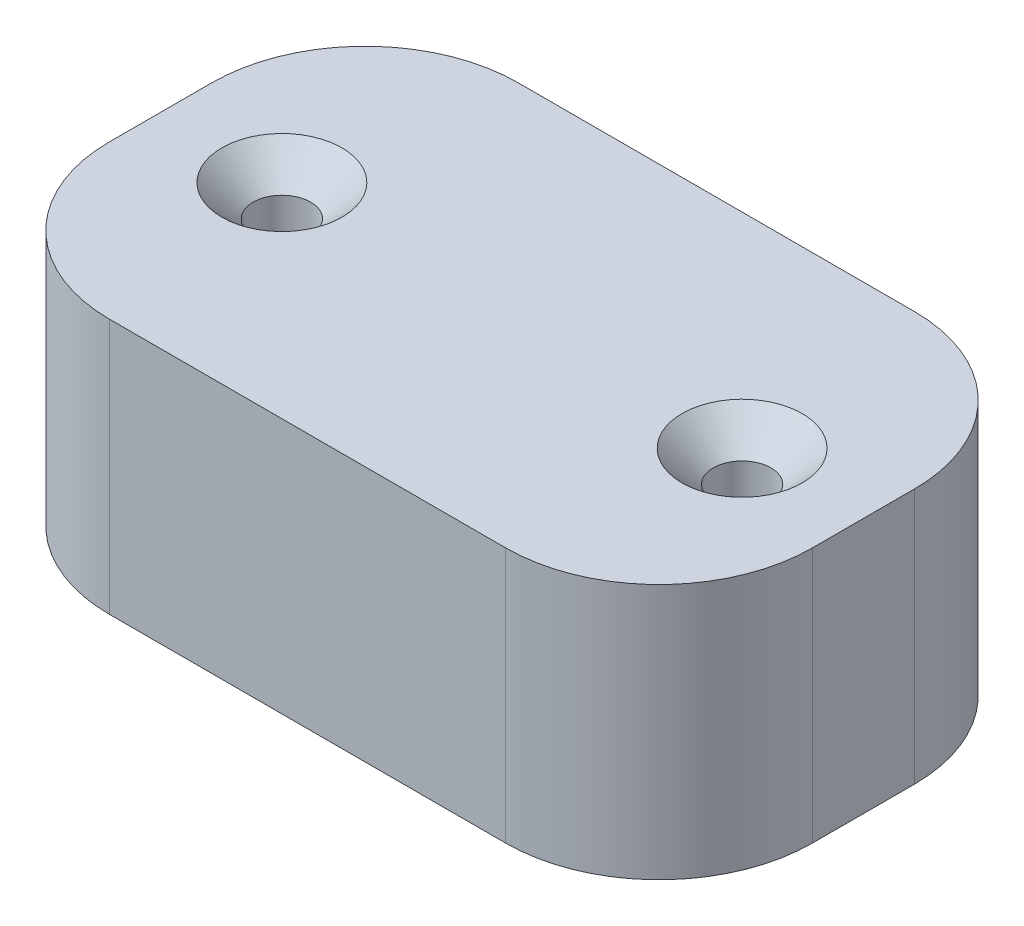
from build123d import *

# Parameters (mm, degrees)
SKETCH1_W                                       = 55
SKETCH1_H                                       = 20
BOSS_EXTRUDE1_DEPTH                             = 16
FILLET1_R                                       = 12
CSK_FOR_M4_FLAT_HEAD_MACHINE_SCREW1_D           = 4.5
CSK_FOR_M4_FLAT_HEAD_MACHINE_SCREW1_CSINK_D     = 9.4
CSK_FOR_M4_FLAT_HEAD_MACHINE_SCREW1_CSINK_ANGLE = 90


with BuildPart() as part:
    # Sketch1 → Boss-Extrude1 (new, symmetric)
    with BuildSketch(Plane.XY):
        with Locations((0, 10)):
            Rectangle(SKETCH1_W, SKETCH1_H)
    extrude(amount=BOSS_EXTRUDE1_DEPTH, both=True)

    # Fillet1
    fillet1_edges = [part.edges().sort_by_distance(p)[0] for p in [
        (27.5, 10, 16),
        (-27.5, 10, 16),
        (27.5, 10, -16),
        (-27.5, 10, -16),
    ]]
    fillet(fillet1_edges, radius=FILLET1_R)

    # CSK for M4 Flat Head Machine Screw1 (through all)
    with Locations(Plane(origin=(0, 20, 0), x_dir=(-1, 0, 0), z_dir=(0, 1, 0))):
        with Locations((18, 0)):
            csk_for_m4_flat_head_machine_screw1 = CounterSinkHole(CSK_FOR_M4_FLAT_HEAD_MACHINE_SCREW1_D / 2, CSK_FOR_M4_FLAT_HEAD_MACHINE_SCREW1_CSINK_D / 2, counter_sink_angle=CSK_FOR_M4_FLAT_HEAD_MACHINE_SCREW1_CSINK_ANGLE)

    # Mirror1: CSK for M4 Flat Head Machine Screw1 across plane
    add(csk_for_m4_flat_head_machine_screw1.mirror(Plane(origin=(0, 0, 0), x_dir=(0, 0, 1), z_dir=(1, 0, 0))), mode=Mode.SUBTRACT)


solid = part.part
